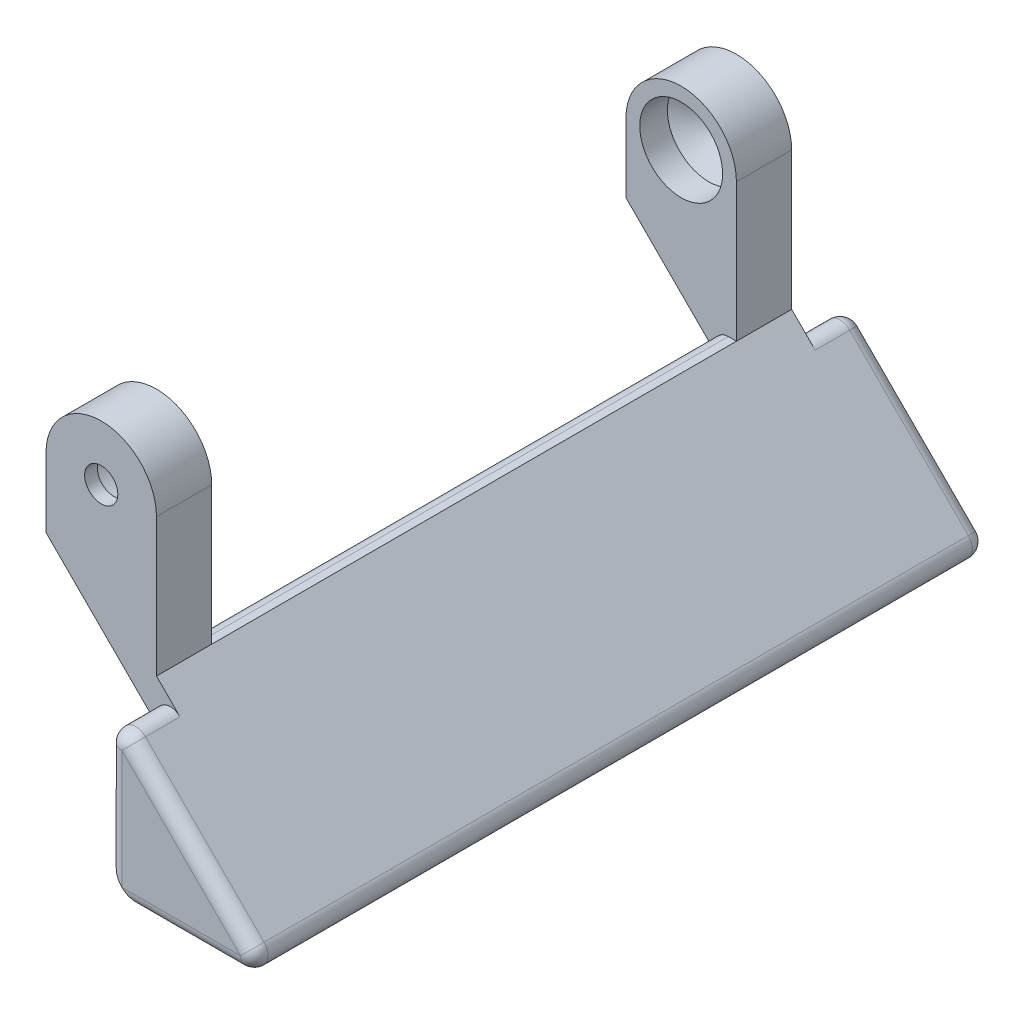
ISO-10303-21;
HEADER;
FILE_DESCRIPTION(('STEP AP214'),'2;1');
FILE_NAME('part.step','',(''),(''),'','','');
FILE_SCHEMA(('AUTOMOTIVE_DESIGN { 1 0 10303 214 1 1 1 1 }'));
ENDSEC;
DATA;
#1=APPLICATION_CONTEXT('core data for automotive mechanical design processes');
#2=APPLICATION_PROTOCOL_DEFINITION('international standard','automotive_design',2000,#1);
#3=PRODUCT_CONTEXT('',#1,'mechanical');
#4=PRODUCT('Part','Part','',(#3));
#5=PRODUCT_RELATED_PRODUCT_CATEGORY('part','',(#4));
#6=PRODUCT_DEFINITION_FORMATION('','',#4);
#7=PRODUCT_DEFINITION_CONTEXT('part definition',#1,'design');
#8=PRODUCT_DEFINITION('design','',#6,#7);
#9=PRODUCT_DEFINITION_SHAPE('','',#8);
#10=(LENGTH_UNIT() NAMED_UNIT(*) SI_UNIT(.MILLI.,.METRE.));
#11=(NAMED_UNIT(*) PLANE_ANGLE_UNIT() SI_UNIT($,.RADIAN.));
#12=(NAMED_UNIT(*) SI_UNIT($,.STERADIAN.) SOLID_ANGLE_UNIT());
#13=UNCERTAINTY_MEASURE_WITH_UNIT(LENGTH_MEASURE(1.E-05),#10,'distance_accuracy_value','');
#14=(GEOMETRIC_REPRESENTATION_CONTEXT(3) GLOBAL_UNCERTAINTY_ASSIGNED_CONTEXT((#13)) GLOBAL_UNIT_ASSIGNED_CONTEXT((#10,
#11,#12)) REPRESENTATION_CONTEXT('',''));
#15=CARTESIAN_POINT('',(0.,0.,0.));
#16=DIRECTION('',(0.,0.,1.));
#17=DIRECTION('',(1.,0.,0.));
#18=AXIS2_PLACEMENT_3D('',#15,#16,#17);
#19=CARTESIAN_POINT('',(0.,0.,53.));
#20=DIRECTION('',(1.,0.,0.));
#21=DIRECTION('',(0.,0.,-1.));
#22=AXIS2_PLACEMENT_3D('',#19,#20,#21);
#23=PLANE('',#22);
#24=DIRECTION('',(0.,1.,0.));
#25=VECTOR('',#24,1.);
#26=CARTESIAN_POINT('',(0.,0.,3.5));
#27=LINE('',#26,#25);
#28=CARTESIAN_POINT('',(0.,17.,3.5));
#29=VERTEX_POINT('',#28);
#30=CARTESIAN_POINT('',(0.,22.,3.5));
#31=VERTEX_POINT('',#30);
#32=EDGE_CURVE('E422',#29,#31,#27,.T.);
#33=ORIENTED_EDGE('',*,*,#32,.F.);
#34=DIRECTION('',(0.,0.,1.));
#35=VECTOR('',#34,1.);
#36=CARTESIAN_POINT('',(0.,17.,0.));
#37=LINE('',#36,#35);
#38=CARTESIAN_POINT('',(0.,17.,7.5));
#39=VERTEX_POINT('',#38);
#40=EDGE_CURVE('E219',#29,#39,#37,.T.);
#41=ORIENTED_EDGE('',*,*,#40,.T.);
#42=DIRECTION('',(0.,1.,0.));
#43=VECTOR('',#42,1.);
#44=CARTESIAN_POINT('',(0.,19.9999999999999,7.5));
#45=LINE('',#44,#43);
#46=CARTESIAN_POINT('',(0.,22.,7.5));
#47=VERTEX_POINT('',#46);
#48=EDGE_CURVE('E417',#39,#47,#45,.T.);
#49=ORIENTED_EDGE('',*,*,#48,.T.);
#50=DIRECTION('',(0.,0.,-1.));
#51=VECTOR('',#50,1.);
#52=CARTESIAN_POINT('',(0.,22.,53.));
#53=LINE('',#52,#51);
#54=EDGE_CURVE('E249',#47,#31,#53,.T.);
#55=ORIENTED_EDGE('',*,*,#54,.T.);
#56=EDGE_LOOP('',(#33,#41,#49,#55));
#57=FACE_BOUND('',#56,.T.);
#58=ADVANCED_FACE('F47',(#57),#23,.F.);
#59=CARTESIAN_POINT('',(4.,22.,53.));
#60=DIRECTION('',(0.,0.,-1.));
#61=DIRECTION('',(-1.,0.,0.));
#62=AXIS2_PLACEMENT_3D('',#59,#60,#61);
#63=CYLINDRICAL_SURFACE('',#62,4.);
#64=CARTESIAN_POINT('',(4.,22.,45.5));
#65=DIRECTION('',(0.,0.,-1.));
#66=DIRECTION('',(-1.,0.,0.));
#67=AXIS2_PLACEMENT_3D('',#64,#65,#66);
#68=CIRCLE('',#67,4.);
#69=CARTESIAN_POINT('',(8.,22.,45.5));
#70=VERTEX_POINT('',#69);
#71=CARTESIAN_POINT('',(0.,22.,45.5));
#72=VERTEX_POINT('',#71);
#73=EDGE_CURVE('E229',#70,#72,#68,.F.);
#74=ORIENTED_EDGE('',*,*,#73,.T.);
#75=CARTESIAN_POINT('',(0.,22.,49.5));
#76=VERTEX_POINT('',#75);
#77=EDGE_CURVE('E246',#76,#72,#53,.T.);
#78=ORIENTED_EDGE('',*,*,#77,.F.);
#79=CARTESIAN_POINT('',(4.,22.,49.5));
#80=DIRECTION('',(0.,0.,-1.));
#81=DIRECTION('',(-1.,0.,0.));
#82=AXIS2_PLACEMENT_3D('',#79,#80,#81);
#83=CIRCLE('',#82,4.);
#84=CARTESIAN_POINT('',(8.,22.,49.5));
#85=VERTEX_POINT('',#84);
#86=EDGE_CURVE('E223',#76,#85,#83,.T.);
#87=ORIENTED_EDGE('',*,*,#86,.T.);
#88=DIRECTION('',(0.,0.,-1.));
#89=VECTOR('',#88,1.);
#90=CARTESIAN_POINT('',(8.,22.,53.));
#91=LINE('',#90,#89);
#92=EDGE_CURVE('E239',#85,#70,#91,.T.);
#93=ORIENTED_EDGE('',*,*,#92,.T.);
#94=EDGE_LOOP('',(#74,#78,#87,#93));
#95=FACE_BOUND('',#94,.T.);
#96=ADVANCED_FACE('F407',(#95),#63,.T.);
#97=CARTESIAN_POINT('',(8.,11.9999999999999,53.));
#98=DIRECTION('',(-1.,0.,0.));
#99=DIRECTION('',(0.,0.,1.));
#100=AXIS2_PLACEMENT_3D('',#97,#98,#99);
#101=PLANE('',#100);
#102=DIRECTION('',(0.,1.,0.));
#103=VECTOR('',#102,1.);
#104=CARTESIAN_POINT('',(8.,22.,45.5));
#105=LINE('',#104,#103);
#106=CARTESIAN_POINT('',(8.,11.9999999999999,45.5));
#107=VERTEX_POINT('',#106);
#108=EDGE_CURVE('E225',#107,#70,#105,.T.);
#109=ORIENTED_EDGE('',*,*,#108,.T.);
#110=ORIENTED_EDGE('',*,*,#92,.F.);
#111=DIRECTION('',(0.,1.,0.));
#112=VECTOR('',#111,1.);
#113=CARTESIAN_POINT('',(8.,0.,49.5));
#114=LINE('',#113,#112);
#115=CARTESIAN_POINT('',(8.,11.9999999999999,49.5));
#116=VERTEX_POINT('',#115);
#117=EDGE_CURVE('E224',#116,#85,#114,.T.);
#118=ORIENTED_EDGE('',*,*,#117,.F.);
#119=DIRECTION('',(0.,0.,-1.));
#120=VECTOR('',#119,1.);
#121=CARTESIAN_POINT('',(8.,11.9999999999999,53.));
#122=LINE('',#121,#120);
#123=EDGE_CURVE('E245',#116,#107,#122,.T.);
#124=ORIENTED_EDGE('',*,*,#123,.T.);
#125=EDGE_LOOP('',(#109,#110,#118,#124));
#126=FACE_BOUND('',#125,.T.);
#127=ADVANCED_FACE('F403',(#126),#101,.F.);
#128=CARTESIAN_POINT('',(4.,22.,53.));
#129=DIRECTION('',(0.,0.,1.));
#130=DIRECTION('',(1.,0.,0.));
#131=AXIS2_PLACEMENT_3D('',#128,#129,#130);
#132=PLANE('',#131);
#133=DIRECTION('',(-0.707106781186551,0.707106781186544,0.));
#134=VECTOR('',#133,1.);
#135=CARTESIAN_POINT('',(7.29289321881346,11.2928932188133,53.));
#136=LINE('',#135,#134);
#137=CARTESIAN_POINT('',(17.5857864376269,1.,53.));
#138=VERTEX_POINT('',#137);
#139=CARTESIAN_POINT('',(9.,9.58578643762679,53.));
#140=VERTEX_POINT('',#139);
#141=EDGE_CURVE('E302',#138,#140,#136,.T.);
#142=ORIENTED_EDGE('',*,*,#141,.T.);
#143=DIRECTION('',(0.,1.,0.));
#144=VECTOR('',#143,1.);
#145=CARTESIAN_POINT('',(9.,2.,53.));
#146=LINE('',#145,#144);
#147=CARTESIAN_POINT('',(9.00000000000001,0.999999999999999,53.));
#148=VERTEX_POINT('',#147);
#149=EDGE_CURVE('E340',#140,#148,#146,.F.);
#150=ORIENTED_EDGE('',*,*,#149,.T.);
#151=DIRECTION('',(1.,0.,0.));
#152=VECTOR('',#151,1.);
#153=CARTESIAN_POINT('',(20.,1.,53.));
#154=LINE('',#153,#152);
#155=EDGE_CURVE('E300',#148,#138,#154,.T.);
#156=ORIENTED_EDGE('',*,*,#155,.T.);
#157=EDGE_LOOP('',(#142,#150,#156));
#158=FACE_BOUND('',#157,.T.);
#159=ADVANCED_FACE('F385',(#158),#132,.T.);
#160=CARTESIAN_POINT('',(4.,22.,0.));
#161=DIRECTION('',(0.,0.,1.));
#162=DIRECTION('',(1.,0.,0.));
#163=AXIS2_PLACEMENT_3D('',#160,#161,#162);
#164=PLANE('',#163);
#165=DIRECTION('',(1.,0.,0.));
#166=VECTOR('',#165,1.);
#167=CARTESIAN_POINT('',(4.,1.,0.));
#168=LINE('',#167,#166);
#169=CARTESIAN_POINT('',(17.5857864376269,1.,0.));
#170=VERTEX_POINT('',#169);
#171=CARTESIAN_POINT('',(9.00000000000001,1.,0.));
#172=VERTEX_POINT('',#171);
#173=EDGE_CURVE('E290',#170,#172,#168,.F.);
#174=ORIENTED_EDGE('',*,*,#173,.T.);
#175=DIRECTION('',(0.,-1.,0.));
#176=VECTOR('',#175,1.);
#177=CARTESIAN_POINT('',(9.,22.,0.));
#178=LINE('',#177,#176);
#179=CARTESIAN_POINT('',(9.,9.58578643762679,0.));
#180=VERTEX_POINT('',#179);
#181=EDGE_CURVE('E336',#172,#180,#178,.F.);
#182=ORIENTED_EDGE('',*,*,#181,.T.);
#183=DIRECTION('',(-0.707106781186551,0.707106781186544,0.));
#184=VECTOR('',#183,1.);
#185=CARTESIAN_POINT('',(0.292893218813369,18.2928932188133,0.));
#186=LINE('',#185,#184);
#187=EDGE_CURVE('E293',#180,#170,#186,.F.);
#188=ORIENTED_EDGE('',*,*,#187,.T.);
#189=EDGE_LOOP('',(#174,#182,#188));
#190=FACE_BOUND('',#189,.T.);
#191=ADVANCED_FACE('F444',(#190),#164,.F.);
#192=ORIENTED_EDGE('',*,*,#54,.F.);
#193=CARTESIAN_POINT('',(4.,22.,7.5));
#194=DIRECTION('',(0.,0.,-1.));
#195=DIRECTION('',(0.,1.,0.));
#196=AXIS2_PLACEMENT_3D('',#193,#194,#195);
#197=CIRCLE('',#196,4.);
#198=CARTESIAN_POINT('',(8.,22.,7.5));
#199=VERTEX_POINT('',#198);
#200=EDGE_CURVE('E410',#47,#199,#197,.T.);
#201=ORIENTED_EDGE('',*,*,#200,.T.);
#202=CARTESIAN_POINT('',(8.,22.,3.5));
#203=VERTEX_POINT('',#202);
#204=EDGE_CURVE('E238',#199,#203,#91,.T.);
#205=ORIENTED_EDGE('',*,*,#204,.T.);
#206=CARTESIAN_POINT('',(4.,22.,3.5));
#207=DIRECTION('',(0.,0.,1.));
#208=DIRECTION('',(1.,0.,0.));
#209=AXIS2_PLACEMENT_3D('',#206,#207,#208);
#210=CIRCLE('',#209,4.);
#211=EDGE_CURVE('E234',#203,#31,#210,.T.);
#212=ORIENTED_EDGE('',*,*,#211,.T.);
#213=EDGE_LOOP('',(#192,#201,#205,#212));
#214=FACE_BOUND('',#213,.T.);
#215=ADVANCED_FACE('F471',(#214),#63,.T.);
#216=DIRECTION('',(0.,-1.,0.));
#217=VECTOR('',#216,1.);
#218=CARTESIAN_POINT('',(0.,19.9999999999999,45.5));
#219=LINE('',#218,#217);
#220=CARTESIAN_POINT('',(0.,17.,45.5));
#221=VERTEX_POINT('',#220);
#222=EDGE_CURVE('E218',#72,#221,#219,.T.);
#223=ORIENTED_EDGE('',*,*,#222,.T.);
#224=CARTESIAN_POINT('',(0.,17.,49.5));
#225=VERTEX_POINT('',#224);
#226=EDGE_CURVE('E201',#221,#225,#37,.T.);
#227=ORIENTED_EDGE('',*,*,#226,.T.);
#228=DIRECTION('',(0.,-1.,0.));
#229=VECTOR('',#228,1.);
#230=CARTESIAN_POINT('',(0.,0.,49.5));
#231=LINE('',#230,#229);
#232=EDGE_CURVE('E216',#76,#225,#231,.T.);
#233=ORIENTED_EDGE('',*,*,#232,.F.);
#234=ORIENTED_EDGE('',*,*,#77,.T.);
#235=EDGE_LOOP('',(#223,#227,#233,#234));
#236=FACE_BOUND('',#235,.T.);
#237=ADVANCED_FACE('F214',(#236),#23,.F.);
#238=CARTESIAN_POINT('',(0.,0.,53.));
#239=DIRECTION('',(0.,1.,0.));
#240=DIRECTION('',(0.,0.,1.));
#241=AXIS2_PLACEMENT_3D('',#238,#239,#240);
#242=PLANE('',#241);
#243=DIRECTION('',(0.,0.,-1.));
#244=VECTOR('',#243,1.);
#245=CARTESIAN_POINT('',(10.,0.,53.));
#246=LINE('',#245,#244);
#247=CARTESIAN_POINT('',(10.,0.,52.));
#248=VERTEX_POINT('',#247);
#249=CARTESIAN_POINT('',(10.,0.,1.));
#250=VERTEX_POINT('',#249);
#251=EDGE_CURVE('E252',#248,#250,#246,.T.);
#252=ORIENTED_EDGE('',*,*,#251,.T.);
#253=DIRECTION('',(1.,0.,0.));
#254=VECTOR('',#253,1.);
#255=CARTESIAN_POINT('',(0.,0.,1.));
#256=LINE('',#255,#254);
#257=CARTESIAN_POINT('',(17.5857864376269,0.,1.));
#258=VERTEX_POINT('',#257);
#259=EDGE_CURVE('E288',#250,#258,#256,.T.);
#260=ORIENTED_EDGE('',*,*,#259,.T.);
#261=DIRECTION('',(0.,0.,-1.));
#262=VECTOR('',#261,1.);
#263=CARTESIAN_POINT('',(17.5857864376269,0.,53.));
#264=LINE('',#263,#262);
#265=CARTESIAN_POINT('',(17.5857864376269,0.,52.));
#266=VERTEX_POINT('',#265);
#267=EDGE_CURVE('E286',#258,#266,#264,.F.);
#268=ORIENTED_EDGE('',*,*,#267,.T.);
#269=DIRECTION('',(1.,0.,0.));
#270=VECTOR('',#269,1.);
#271=CARTESIAN_POINT('',(10.,0.,52.));
#272=LINE('',#271,#270);
#273=EDGE_CURVE('E284',#266,#248,#272,.F.);
#274=ORIENTED_EDGE('',*,*,#273,.T.);
#275=EDGE_LOOP('',(#252,#260,#268,#274));
#276=FACE_BOUND('',#275,.T.);
#277=ADVANCED_FACE('F453',(#276),#242,.F.);
#278=CARTESIAN_POINT('',(20.,0.,53.));
#279=DIRECTION('',(-0.707106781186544,-0.707106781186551,0.));
#280=DIRECTION('',(0.707106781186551,-0.707106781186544,0.));
#281=AXIS2_PLACEMENT_3D('',#278,#279,#280);
#282=PLANE('',#281);
#283=DIRECTION('',(-0.707106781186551,0.707106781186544,0.));
#284=VECTOR('',#283,1.);
#285=CARTESIAN_POINT('',(20.,0.,1.));
#286=LINE('',#285,#284);
#287=CARTESIAN_POINT('',(18.2928932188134,1.70710678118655,1.));
#288=VERTEX_POINT('',#287);
#289=CARTESIAN_POINT('',(9.70710678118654,10.2928932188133,1.));
#290=VERTEX_POINT('',#289);
#291=EDGE_CURVE('E281',#288,#290,#286,.T.);
#292=ORIENTED_EDGE('',*,*,#291,.T.);
#293=DIRECTION('',(0.,0.,-1.));
#294=VECTOR('',#293,1.);
#295=CARTESIAN_POINT('',(9.70710678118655,10.2928932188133,53.));
#296=LINE('',#295,#294);
#297=CARTESIAN_POINT('',(9.70710678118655,10.2928932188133,3.5));
#298=VERTEX_POINT('',#297);
#299=EDGE_CURVE('E348',#290,#298,#296,.F.);
#300=ORIENTED_EDGE('',*,*,#299,.T.);
#301=DIRECTION('',(-0.707106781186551,0.707106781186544,0.));
#302=VECTOR('',#301,1.);
#303=CARTESIAN_POINT('',(20.,0.,3.5));
#304=LINE('',#303,#302);
#305=CARTESIAN_POINT('',(8.,11.9999999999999,3.5));
#306=VERTEX_POINT('',#305);
#307=EDGE_CURVE('E71',#298,#306,#304,.T.);
#308=ORIENTED_EDGE('',*,*,#307,.T.);
#309=CARTESIAN_POINT('',(8.,12.,7.49999999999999));
#310=VERTEX_POINT('',#309);
#311=EDGE_CURVE('E242',#310,#306,#122,.T.);
#312=ORIENTED_EDGE('',*,*,#311,.F.);
#313=DIRECTION('',(0.,0.,1.));
#314=VECTOR('',#313,1.);
#315=CARTESIAN_POINT('',(7.99999999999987,12.,53.));
#316=LINE('',#315,#314);
#317=EDGE_CURVE('E399',#310,#107,#316,.T.);
#318=ORIENTED_EDGE('',*,*,#317,.T.);
#319=ORIENTED_EDGE('',*,*,#123,.F.);
#320=DIRECTION('',(0.707106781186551,-0.707106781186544,0.));
#321=VECTOR('',#320,1.);
#322=CARTESIAN_POINT('',(20.,0.,49.5));
#323=LINE('',#322,#321);
#324=CARTESIAN_POINT('',(9.70710678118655,10.2928932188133,49.5));
#325=VERTEX_POINT('',#324);
#326=EDGE_CURVE('E63',#116,#325,#323,.T.);
#327=ORIENTED_EDGE('',*,*,#326,.T.);
#328=DIRECTION('',(0.,0.,-1.));
#329=VECTOR('',#328,1.);
#330=CARTESIAN_POINT('',(9.70710678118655,10.2928932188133,53.));
#331=LINE('',#330,#329);
#332=CARTESIAN_POINT('',(9.70710678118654,10.2928932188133,52.));
#333=VERTEX_POINT('',#332);
#334=EDGE_CURVE('E344',#325,#333,#331,.F.);
#335=ORIENTED_EDGE('',*,*,#334,.T.);
#336=DIRECTION('',(-0.707106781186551,0.707106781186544,0.));
#337=VECTOR('',#336,1.);
#338=CARTESIAN_POINT('',(20.,0.,52.));
#339=LINE('',#338,#337);
#340=CARTESIAN_POINT('',(18.2928932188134,1.70710678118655,52.));
#341=VERTEX_POINT('',#340);
#342=EDGE_CURVE('E276',#333,#341,#339,.F.);
#343=ORIENTED_EDGE('',*,*,#342,.T.);
#344=DIRECTION('',(0.,0.,-1.));
#345=VECTOR('',#344,1.);
#346=CARTESIAN_POINT('',(18.2928932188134,1.70710678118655,53.));
#347=LINE('',#346,#345);
#348=EDGE_CURVE('E278',#341,#288,#347,.T.);
#349=ORIENTED_EDGE('',*,*,#348,.T.);
#350=EDGE_LOOP('',(#292,#300,#308,#312,#318,#319,#327,#335,#343,#349));
#351=FACE_BOUND('',#350,.T.);
#352=ADVANCED_FACE('F392',(#351),#282,.F.);
#353=ORIENTED_EDGE('',*,*,#204,.F.);
#354=DIRECTION('',(0.,-1.,0.));
#355=VECTOR('',#354,1.);
#356=CARTESIAN_POINT('',(8.,22.,7.5));
#357=LINE('',#356,#355);
#358=EDGE_CURVE('E414',#199,#310,#357,.T.);
#359=ORIENTED_EDGE('',*,*,#358,.T.);
#360=ORIENTED_EDGE('',*,*,#311,.T.);
#361=DIRECTION('',(0.,-1.,0.));
#362=VECTOR('',#361,1.);
#363=CARTESIAN_POINT('',(8.,0.,3.5));
#364=LINE('',#363,#362);
#365=EDGE_CURVE('E235',#203,#306,#364,.T.);
#366=ORIENTED_EDGE('',*,*,#365,.F.);
#367=EDGE_LOOP('',(#353,#359,#360,#366));
#368=FACE_BOUND('',#367,.T.);
#369=ADVANCED_FACE('F467',(#368),#101,.F.);
#370=CARTESIAN_POINT('',(8.,0.,0.));
#371=DIRECTION('',(1.,0.,0.));
#372=DIRECTION('',(0.,0.,-1.));
#373=AXIS2_PLACEMENT_3D('',#370,#371,#372);
#374=PLANE('',#373);
#375=DIRECTION('',(0.,0.,-1.));
#376=VECTOR('',#375,1.);
#377=CARTESIAN_POINT('',(8.,9.58578643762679,0.));
#378=LINE('',#377,#376);
#379=CARTESIAN_POINT('',(8.,9.58578643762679,3.5));
#380=VERTEX_POINT('',#379);
#381=CARTESIAN_POINT('',(8.,9.58578643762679,1.));
#382=VERTEX_POINT('',#381);
#383=EDGE_CURVE('E327',#380,#382,#378,.T.);
#384=ORIENTED_EDGE('',*,*,#383,.T.);
#385=DIRECTION('',(0.,-1.,0.));
#386=VECTOR('',#385,1.);
#387=CARTESIAN_POINT('',(8.,0.,1.));
#388=LINE('',#387,#386);
#389=CARTESIAN_POINT('',(8.,2.,1.));
#390=VERTEX_POINT('',#389);
#391=EDGE_CURVE('E329',#382,#390,#388,.T.);
#392=ORIENTED_EDGE('',*,*,#391,.T.);
#393=DIRECTION('',(0.,0.,1.));
#394=VECTOR('',#393,1.);
#395=CARTESIAN_POINT('',(8.,2.,0.));
#396=LINE('',#395,#394);
#397=CARTESIAN_POINT('',(8.,2.,52.));
#398=VERTEX_POINT('',#397);
#399=EDGE_CURVE('E248',#390,#398,#396,.T.);
#400=ORIENTED_EDGE('',*,*,#399,.T.);
#401=DIRECTION('',(0.,1.,0.));
#402=VECTOR('',#401,1.);
#403=CARTESIAN_POINT('',(8.,10.5857864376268,52.));
#404=LINE('',#403,#402);
#405=CARTESIAN_POINT('',(8.,9.58578643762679,52.));
#406=VERTEX_POINT('',#405);
#407=EDGE_CURVE('E324',#398,#406,#404,.T.);
#408=ORIENTED_EDGE('',*,*,#407,.T.);
#409=DIRECTION('',(0.,0.,-1.));
#410=VECTOR('',#409,1.);
#411=CARTESIAN_POINT('',(8.,9.58578643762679,0.));
#412=LINE('',#411,#410);
#413=CARTESIAN_POINT('',(8.,9.58578643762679,49.5));
#414=VERTEX_POINT('',#413);
#415=EDGE_CURVE('E305',#406,#414,#412,.T.);
#416=ORIENTED_EDGE('',*,*,#415,.T.);
#417=CARTESIAN_POINT('',(8.,9.,49.5));
#418=VERTEX_POINT('',#417);
#419=EDGE_CURVE('E227',#418,#414,#114,.T.);
#420=ORIENTED_EDGE('',*,*,#419,.F.);
#421=DIRECTION('',(0.,0.,-1.));
#422=VECTOR('',#421,1.);
#423=CARTESIAN_POINT('',(8.,9.,3.5));
#424=LINE('',#423,#422);
#425=CARTESIAN_POINT('',(8.,9.,3.5));
#426=VERTEX_POINT('',#425);
#427=EDGE_CURVE('E205',#418,#426,#424,.T.);
#428=ORIENTED_EDGE('',*,*,#427,.T.);
#429=EDGE_CURVE('E421',#380,#426,#364,.T.);
#430=ORIENTED_EDGE('',*,*,#429,.F.);
#431=EDGE_LOOP('',(#384,#392,#400,#408,#416,#420,#428,#430));
#432=FACE_BOUND('',#431,.T.);
#433=ADVANCED_FACE('F370',(#432),#374,.F.);
#434=CARTESIAN_POINT('',(34.2345192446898,0.,49.5));
#435=DIRECTION('',(0.,0.,-1.));
#436=DIRECTION('',(-1.,0.,0.));
#437=AXIS2_PLACEMENT_3D('',#434,#435,#436);
#438=PLANE('',#437);
#439=CARTESIAN_POINT('',(4.,22.,49.5));
#440=DIRECTION('',(0.,0.,-1.));
#441=DIRECTION('',(-1.,0.,0.));
#442=AXIS2_PLACEMENT_3D('',#439,#440,#441);
#443=CIRCLE('',#442,1.2);
#444=CARTESIAN_POINT('',(2.8,22.,49.5));
#445=VERTEX_POINT('',#444);
#446=EDGE_CURVE('E261',#445,#445,#443,.T.);
#447=ORIENTED_EDGE('',*,*,#446,.T.);
#448=EDGE_LOOP('',(#447));
#449=FACE_BOUND('',#448,.T.);
#450=ORIENTED_EDGE('',*,*,#232,.T.);
#451=DIRECTION('',(-0.707106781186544,0.707106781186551,0.));
#452=VECTOR('',#451,1.);
#453=CARTESIAN_POINT('',(25.6172596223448,-8.61725962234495,49.5));
#454=LINE('',#453,#452);
#455=EDGE_CURVE('E198',#225,#418,#454,.F.);
#456=ORIENTED_EDGE('',*,*,#455,.T.);
#457=ORIENTED_EDGE('',*,*,#419,.T.);
#458=CARTESIAN_POINT('',(9.,9.58578643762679,49.5));
#459=DIRECTION('',(0.,0.,-1.));
#460=DIRECTION('',(-1.,0.,0.));
#461=AXIS2_PLACEMENT_3D('',#458,#459,#460);
#462=CIRCLE('',#461,1.);
#463=EDGE_CURVE('E13',#414,#325,#462,.T.);
#464=ORIENTED_EDGE('',*,*,#463,.T.);
#465=ORIENTED_EDGE('',*,*,#326,.F.);
#466=ORIENTED_EDGE('',*,*,#117,.T.);
#467=ORIENTED_EDGE('',*,*,#86,.F.);
#468=EDGE_LOOP('',(#450,#456,#457,#464,#465,#466,#467));
#469=FACE_BOUND('',#468,.T.);
#470=ADVANCED_FACE('F222',(#449,#469),#438,.F.);
#471=CARTESIAN_POINT('',(34.2345192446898,0.,3.5));
#472=DIRECTION('',(0.,0.,1.));
#473=DIRECTION('',(1.,0.,0.));
#474=AXIS2_PLACEMENT_3D('',#471,#472,#473);
#475=PLANE('',#474);
#476=CARTESIAN_POINT('',(4.,22.,3.5));
#477=DIRECTION('',(0.,0.,1.));
#478=DIRECTION('',(1.,0.,0.));
#479=AXIS2_PLACEMENT_3D('',#476,#477,#478);
#480=CIRCLE('',#479,1.2);
#481=CARTESIAN_POINT('',(5.2,22.,3.5));
#482=VERTEX_POINT('',#481);
#483=EDGE_CURVE('E257',#482,#482,#480,.T.);
#484=ORIENTED_EDGE('',*,*,#483,.T.);
#485=EDGE_LOOP('',(#484));
#486=FACE_BOUND('',#485,.T.);
#487=DIRECTION('',(0.707106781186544,-0.707106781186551,0.));
#488=VECTOR('',#487,1.);
#489=CARTESIAN_POINT('',(25.6172596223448,-8.61725962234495,3.5));
#490=LINE('',#489,#488);
#491=EDGE_CURVE('E209',#426,#29,#490,.F.);
#492=ORIENTED_EDGE('',*,*,#491,.T.);
#493=ORIENTED_EDGE('',*,*,#32,.T.);
#494=ORIENTED_EDGE('',*,*,#211,.F.);
#495=ORIENTED_EDGE('',*,*,#365,.T.);
#496=ORIENTED_EDGE('',*,*,#307,.F.);
#497=CARTESIAN_POINT('',(9.,9.58578643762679,3.5));
#498=DIRECTION('',(0.,0.,1.));
#499=DIRECTION('',(1.,0.,0.));
#500=AXIS2_PLACEMENT_3D('',#497,#498,#499);
#501=CIRCLE('',#500,1.);
#502=EDGE_CURVE('E56',#298,#380,#501,.T.);
#503=ORIENTED_EDGE('',*,*,#502,.T.);
#504=ORIENTED_EDGE('',*,*,#429,.T.);
#505=EDGE_LOOP('',(#492,#493,#494,#495,#496,#503,#504));
#506=FACE_BOUND('',#505,.T.);
#507=ADVANCED_FACE('F468',(#486,#506),#475,.F.);
#508=CARTESIAN_POINT('',(8.,2.,0.));
#509=DIRECTION('',(0.707106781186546,0.707106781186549,0.));
#510=DIRECTION('',(0.,0.,1.));
#511=AXIS2_PLACEMENT_3D('',#508,#509,#510);
#512=PLANE('',#511);
#513=ORIENTED_EDGE('',*,*,#399,.F.);
#514=CARTESIAN_POINT('',(9.,1.,1.));
#515=DIRECTION('',(0.707106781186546,0.707106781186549,0.));
#516=DIRECTION('',(0.707106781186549,-0.707106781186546,0.));
#517=AXIS2_PLACEMENT_3D('',#514,#515,#516);
#518=ELLIPSE('',#517,1.41421356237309,1.);
#519=EDGE_CURVE('E334',#390,#172,#518,.F.);
#520=ORIENTED_EDGE('',*,*,#519,.T.);
#521=CARTESIAN_POINT('',(9.00000000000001,1.,1.));
#522=DIRECTION('',(0.707106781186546,0.707106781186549,0.));
#523=DIRECTION('',(0.707106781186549,-0.707106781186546,0.));
#524=AXIS2_PLACEMENT_3D('',#521,#522,#523);
#525=ELLIPSE('',#524,1.4142135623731,1.);
#526=EDGE_CURVE('E298',#172,#250,#525,.F.);
#527=ORIENTED_EDGE('',*,*,#526,.T.);
#528=ORIENTED_EDGE('',*,*,#251,.F.);
#529=CARTESIAN_POINT('',(9.00000000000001,1.,52.));
#530=DIRECTION('',(0.707106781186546,0.707106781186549,0.));
#531=DIRECTION('',(-0.707106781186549,0.707106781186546,0.));
#532=AXIS2_PLACEMENT_3D('',#529,#530,#531);
#533=ELLIPSE('',#532,1.4142135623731,1.);
#534=EDGE_CURVE('E295',#248,#148,#533,.F.);
#535=ORIENTED_EDGE('',*,*,#534,.T.);
#536=CARTESIAN_POINT('',(9.,1.,52.));
#537=DIRECTION('',(0.707106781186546,0.707106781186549,0.));
#538=DIRECTION('',(0.707106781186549,-0.707106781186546,0.));
#539=AXIS2_PLACEMENT_3D('',#536,#537,#538);
#540=ELLIPSE('',#539,1.41421356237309,1.);
#541=EDGE_CURVE('E332',#148,#398,#540,.F.);
#542=ORIENTED_EDGE('',*,*,#541,.T.);
#543=EDGE_LOOP('',(#513,#520,#527,#528,#535,#542));
#544=FACE_BOUND('',#543,.T.);
#545=ADVANCED_FACE('F375',(#544),#512,.F.);
#546=CARTESIAN_POINT('',(8.,9.,0.));
#547=DIRECTION('',(-0.707106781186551,-0.707106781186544,0.));
#548=DIRECTION('',(0.,0.,1.));
#549=AXIS2_PLACEMENT_3D('',#546,#547,#548);
#550=PLANE('',#549);
#551=DIRECTION('',(0.707106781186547,-0.707106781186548,0.));
#552=VECTOR('',#551,1.);
#553=CARTESIAN_POINT('',(25.6172596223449,-8.61725962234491,45.5));
#554=LINE('',#553,#552);
#555=CARTESIAN_POINT('',(6.70710678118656,10.2928932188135,45.5));
#556=VERTEX_POINT('',#555);
#557=EDGE_CURVE('E502',#221,#556,#554,.T.);
#558=ORIENTED_EDGE('',*,*,#557,.T.);
#559=DIRECTION('',(0.,0.,1.));
#560=VECTOR('',#559,1.);
#561=CARTESIAN_POINT('',(6.70710678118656,10.2928932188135,0.));
#562=LINE('',#561,#560);
#563=CARTESIAN_POINT('',(6.70710678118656,10.2928932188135,7.5));
#564=VERTEX_POINT('',#563);
#565=EDGE_CURVE('E268',#556,#564,#562,.F.);
#566=ORIENTED_EDGE('',*,*,#565,.T.);
#567=DIRECTION('',(0.707106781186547,-0.707106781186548,0.));
#568=VECTOR('',#567,1.);
#569=CARTESIAN_POINT('',(-0.499999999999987,17.5,7.5));
#570=LINE('',#569,#568);
#571=EDGE_CURVE('E265',#39,#564,#570,.T.);
#572=ORIENTED_EDGE('',*,*,#571,.F.);
#573=ORIENTED_EDGE('',*,*,#40,.F.);
#574=ORIENTED_EDGE('',*,*,#491,.F.);
#575=ORIENTED_EDGE('',*,*,#427,.F.);
#576=ORIENTED_EDGE('',*,*,#455,.F.);
#577=ORIENTED_EDGE('',*,*,#226,.F.);
#578=EDGE_LOOP('',(#558,#566,#572,#573,#574,#575,#576,#577));
#579=FACE_BOUND('',#578,.T.);
#580=ADVANCED_FACE('F200',(#579),#550,.T.);
#581=CARTESIAN_POINT('',(4.,22.,7.5));
#582=DIRECTION('',(0.,0.,-1.));
#583=DIRECTION('',(0.,1.,0.));
#584=AXIS2_PLACEMENT_3D('',#581,#582,#583);
#585=PLANE('',#584);
#586=CARTESIAN_POINT('',(4.,22.,7.50000000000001));
#587=DIRECTION('',(0.,0.,1.));
#588=DIRECTION('',(0.,-1.,0.));
#589=AXIS2_PLACEMENT_3D('',#586,#587,#588);
#590=CIRCLE('',#589,2.99999999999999);
#591=CARTESIAN_POINT('',(4.,19.,7.50000000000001));
#592=VERTEX_POINT('',#591);
#593=EDGE_CURVE('E488',#592,#592,#590,.T.);
#594=ORIENTED_EDGE('',*,*,#593,.F.);
#595=EDGE_LOOP('',(#594));
#596=FACE_BOUND('',#595,.T.);
#597=ORIENTED_EDGE('',*,*,#48,.F.);
#598=ORIENTED_EDGE('',*,*,#571,.T.);
#599=CARTESIAN_POINT('',(7.41421356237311,11.,7.5));
#600=DIRECTION('',(0.,0.,-1.));
#601=DIRECTION('',(0.,1.,0.));
#602=AXIS2_PLACEMENT_3D('',#599,#600,#601);
#603=CIRCLE('',#602,1.);
#604=CARTESIAN_POINT('',(7.41421356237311,12.,7.49999999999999));
#605=VERTEX_POINT('',#604);
#606=EDGE_CURVE('E274',#564,#605,#603,.T.);
#607=ORIENTED_EDGE('',*,*,#606,.T.);
#608=DIRECTION('',(1.,0.,0.));
#609=VECTOR('',#608,1.);
#610=CARTESIAN_POINT('',(0.,12.,7.49999999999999));
#611=LINE('',#610,#609);
#612=EDGE_CURVE('E477',#605,#310,#611,.T.);
#613=ORIENTED_EDGE('',*,*,#612,.T.);
#614=ORIENTED_EDGE('',*,*,#358,.F.);
#615=ORIENTED_EDGE('',*,*,#200,.F.);
#616=EDGE_LOOP('',(#597,#598,#607,#613,#614,#615));
#617=FACE_BOUND('',#616,.T.);
#618=ADVANCED_FACE('F475',(#596,#617),#585,.F.);
#619=CARTESIAN_POINT('',(34.2345192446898,0.,45.5));
#620=DIRECTION('',(0.,0.,-1.));
#621=DIRECTION('',(-1.,0.,0.));
#622=AXIS2_PLACEMENT_3D('',#619,#620,#621);
#623=PLANE('',#622);
#624=ORIENTED_EDGE('',*,*,#557,.F.);
#625=ORIENTED_EDGE('',*,*,#222,.F.);
#626=ORIENTED_EDGE('',*,*,#73,.F.);
#627=ORIENTED_EDGE('',*,*,#108,.F.);
#628=DIRECTION('',(1.,0.,0.));
#629=VECTOR('',#628,1.);
#630=CARTESIAN_POINT('',(0.,12.,45.5));
#631=LINE('',#630,#629);
#632=CARTESIAN_POINT('',(7.41421356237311,12.,45.5));
#633=VERTEX_POINT('',#632);
#634=EDGE_CURVE('E481',#633,#107,#631,.T.);
#635=ORIENTED_EDGE('',*,*,#634,.F.);
#636=CARTESIAN_POINT('',(7.41421356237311,11.,45.5));
#637=DIRECTION('',(0.,0.,-1.));
#638=DIRECTION('',(-1.,0.,0.));
#639=AXIS2_PLACEMENT_3D('',#636,#637,#638);
#640=CIRCLE('',#639,1.);
#641=EDGE_CURVE('E271',#633,#556,#640,.F.);
#642=ORIENTED_EDGE('',*,*,#641,.T.);
#643=EDGE_LOOP('',(#624,#625,#626,#627,#635,#642));
#644=FACE_BOUND('',#643,.T.);
#645=CARTESIAN_POINT('',(4.,22.,45.5));
#646=DIRECTION('',(0.,0.,-1.));
#647=DIRECTION('',(-1.,0.,0.));
#648=AXIS2_PLACEMENT_3D('',#645,#646,#647);
#649=CIRCLE('',#648,2.99999999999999);
#650=CARTESIAN_POINT('',(1.00000000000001,22.,45.5));
#651=VERTEX_POINT('',#650);
#652=EDGE_CURVE('E494',#651,#651,#649,.T.);
#653=ORIENTED_EDGE('',*,*,#652,.F.);
#654=EDGE_LOOP('',(#653));
#655=FACE_BOUND('',#654,.T.);
#656=ADVANCED_FACE('F511',(#644,#655),#623,.T.);
#657=CARTESIAN_POINT('',(0.,12.,45.5));
#658=DIRECTION('',(0.,-1.,0.));
#659=DIRECTION('',(0.,0.,-1.));
#660=AXIS2_PLACEMENT_3D('',#657,#658,#659);
#661=PLANE('',#660);
#662=ORIENTED_EDGE('',*,*,#612,.F.);
#663=DIRECTION('',(0.,0.,-1.));
#664=VECTOR('',#663,1.);
#665=CARTESIAN_POINT('',(7.41421356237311,12.,45.5));
#666=LINE('',#665,#664);
#667=EDGE_CURVE('E208',#605,#633,#666,.F.);
#668=ORIENTED_EDGE('',*,*,#667,.T.);
#669=ORIENTED_EDGE('',*,*,#634,.T.);
#670=ORIENTED_EDGE('',*,*,#317,.F.);
#671=EDGE_LOOP('',(#662,#668,#669,#670));
#672=FACE_BOUND('',#671,.T.);
#673=ADVANCED_FACE('F510',(#672),#661,.F.);
#674=CARTESIAN_POINT('',(4.,22.,5.5));
#675=DIRECTION('',(0.,0.,1.));
#676=DIRECTION('',(0.,-1.,0.));
#677=AXIS2_PLACEMENT_3D('',#674,#675,#676);
#678=CONICAL_SURFACE('',#677,3.,1.02974425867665);
#679=CARTESIAN_POINT('',(4.,22.,4.41845088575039));
#680=DIRECTION('',(0.,0.,1.));
#681=DIRECTION('',(0.,-1.,0.));
#682=AXIS2_PLACEMENT_3D('',#679,#680,#681);
#683=CIRCLE('',#682,1.2);
#684=CARTESIAN_POINT('',(4.,20.8,4.41845088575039));
#685=VERTEX_POINT('',#684);
#686=EDGE_CURVE('E260',#685,#685,#683,.F.);
#687=ORIENTED_EDGE('',*,*,#686,.T.);
#688=EDGE_LOOP('',(#687));
#689=FACE_BOUND('',#688,.T.);
#690=CARTESIAN_POINT('',(4.,22.,5.5));
#691=DIRECTION('',(0.,0.,1.));
#692=DIRECTION('',(0.,-1.,0.));
#693=AXIS2_PLACEMENT_3D('',#690,#691,#692);
#694=CIRCLE('',#693,3.);
#695=CARTESIAN_POINT('',(4.,19.,5.50000000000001));
#696=VERTEX_POINT('',#695);
#697=EDGE_CURVE('E483',#696,#696,#694,.T.);
#698=ORIENTED_EDGE('',*,*,#697,.T.);
#699=EDGE_LOOP('',(#698));
#700=FACE_BOUND('',#699,.T.);
#701=ADVANCED_FACE('F705',(#689,#700),#678,.F.);
#702=CARTESIAN_POINT('',(4.,22.,7.5));
#703=DIRECTION('',(0.,0.,1.));
#704=DIRECTION('',(0.,-1.,0.));
#705=AXIS2_PLACEMENT_3D('',#702,#703,#704);
#706=CYLINDRICAL_SURFACE('',#705,2.99999999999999);
#707=ORIENTED_EDGE('',*,*,#697,.F.);
#708=EDGE_LOOP('',(#707));
#709=FACE_BOUND('',#708,.T.);
#710=ORIENTED_EDGE('',*,*,#593,.T.);
#711=EDGE_LOOP('',(#710));
#712=FACE_BOUND('',#711,.T.);
#713=ADVANCED_FACE('F530',(#709,#712),#706,.F.);
#714=CARTESIAN_POINT('',(4.,22.,47.5));
#715=DIRECTION('',(0.,0.,-1.));
#716=DIRECTION('',(-1.,0.,0.));
#717=AXIS2_PLACEMENT_3D('',#714,#715,#716);
#718=CONICAL_SURFACE('',#717,2.99999999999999,1.02974425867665);
#719=CARTESIAN_POINT('',(4.,22.,48.5815491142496));
#720=DIRECTION('',(0.,0.,-1.));
#721=DIRECTION('',(-1.,0.,0.));
#722=AXIS2_PLACEMENT_3D('',#719,#720,#721);
#723=CIRCLE('',#722,1.2);
#724=CARTESIAN_POINT('',(2.8,22.,48.5815491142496));
#725=VERTEX_POINT('',#724);
#726=EDGE_CURVE('E262',#725,#725,#723,.F.);
#727=ORIENTED_EDGE('',*,*,#726,.T.);
#728=EDGE_LOOP('',(#727));
#729=FACE_BOUND('',#728,.T.);
#730=CARTESIAN_POINT('',(4.,22.,47.5));
#731=DIRECTION('',(0.,0.,-1.));
#732=DIRECTION('',(-1.,0.,0.));
#733=AXIS2_PLACEMENT_3D('',#730,#731,#732);
#734=CIRCLE('',#733,2.99999999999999);
#735=CARTESIAN_POINT('',(1.00000000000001,22.,47.5));
#736=VERTEX_POINT('',#735);
#737=EDGE_CURVE('E491',#736,#736,#734,.T.);
#738=ORIENTED_EDGE('',*,*,#737,.T.);
#739=EDGE_LOOP('',(#738));
#740=FACE_BOUND('',#739,.T.);
#741=ADVANCED_FACE('F520',(#729,#740),#718,.F.);
#742=CARTESIAN_POINT('',(4.,22.,45.5));
#743=DIRECTION('',(0.,0.,-1.));
#744=DIRECTION('',(-1.,0.,0.));
#745=AXIS2_PLACEMENT_3D('',#742,#743,#744);
#746=CYLINDRICAL_SURFACE('',#745,2.99999999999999);
#747=ORIENTED_EDGE('',*,*,#737,.F.);
#748=EDGE_LOOP('',(#747));
#749=FACE_BOUND('',#748,.T.);
#750=ORIENTED_EDGE('',*,*,#652,.T.);
#751=EDGE_LOOP('',(#750));
#752=FACE_BOUND('',#751,.T.);
#753=ADVANCED_FACE('F517',(#749,#752),#746,.F.);
#754=CARTESIAN_POINT('',(4.,22.,7.5));
#755=DIRECTION('',(0.,0.,1.));
#756=DIRECTION('',(0.,-1.,0.));
#757=AXIS2_PLACEMENT_3D('',#754,#755,#756);
#758=CYLINDRICAL_SURFACE('',#757,1.2);
#759=ORIENTED_EDGE('',*,*,#483,.F.);
#760=EDGE_LOOP('',(#759));
#761=FACE_BOUND('',#760,.T.);
#762=ORIENTED_EDGE('',*,*,#686,.F.);
#763=EDGE_LOOP('',(#762));
#764=FACE_BOUND('',#763,.T.);
#765=ADVANCED_FACE('F519',(#761,#764),#758,.F.);
#766=CARTESIAN_POINT('',(4.,22.,45.5));
#767=DIRECTION('',(0.,0.,-1.));
#768=DIRECTION('',(-1.,0.,0.));
#769=AXIS2_PLACEMENT_3D('',#766,#767,#768);
#770=CYLINDRICAL_SURFACE('',#769,1.2);
#771=ORIENTED_EDGE('',*,*,#726,.F.);
#772=EDGE_LOOP('',(#771));
#773=FACE_BOUND('',#772,.T.);
#774=ORIENTED_EDGE('',*,*,#446,.F.);
#775=EDGE_LOOP('',(#774));
#776=FACE_BOUND('',#775,.T.);
#777=ADVANCED_FACE('F527',(#773,#776),#770,.F.);
#778=CARTESIAN_POINT('',(7.41421356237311,11.,45.5));
#779=DIRECTION('',(0.,0.,-1.));
#780=DIRECTION('',(-1.,0.,0.));
#781=AXIS2_PLACEMENT_3D('',#778,#779,#780);
#782=CYLINDRICAL_SURFACE('',#781,1.);
#783=ORIENTED_EDGE('',*,*,#606,.F.);
#784=ORIENTED_EDGE('',*,*,#565,.F.);
#785=ORIENTED_EDGE('',*,*,#641,.F.);
#786=ORIENTED_EDGE('',*,*,#667,.F.);
#787=EDGE_LOOP('',(#783,#784,#785,#786));
#788=FACE_BOUND('',#787,.T.);
#789=ADVANCED_FACE('F508',(#788),#782,.T.);
#790=CARTESIAN_POINT('',(4.,1.,52.));
#791=DIRECTION('',(-1.,0.,0.));
#792=DIRECTION('',(0.,0.,1.));
#793=AXIS2_PLACEMENT_3D('',#790,#791,#792);
#794=CYLINDRICAL_SURFACE('',#793,1.);
#795=ORIENTED_EDGE('',*,*,#534,.F.);
#796=ORIENTED_EDGE('',*,*,#273,.F.);
#797=CARTESIAN_POINT('',(17.5857864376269,1.,52.));
#798=DIRECTION('',(1.,0.,0.));
#799=DIRECTION('',(0.,0.,-1.));
#800=AXIS2_PLACEMENT_3D('',#797,#798,#799);
#801=CIRCLE('',#800,1.);
#802=EDGE_CURVE('E220',#138,#266,#801,.T.);
#803=ORIENTED_EDGE('',*,*,#802,.F.);
#804=ORIENTED_EDGE('',*,*,#155,.F.);
#805=EDGE_LOOP('',(#795,#796,#803,#804));
#806=FACE_BOUND('',#805,.T.);
#807=ADVANCED_FACE('F382',(#806),#794,.T.);
#808=CARTESIAN_POINT('',(0.29289321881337,18.2928932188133,52.));
#809=DIRECTION('',(0.707106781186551,-0.707106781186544,0.));
#810=DIRECTION('',(0.707106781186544,0.707106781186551,0.));
#811=AXIS2_PLACEMENT_3D('',#808,#809,#810);
#812=CYLINDRICAL_SURFACE('',#811,1.);
#813=ORIENTED_EDGE('',*,*,#342,.F.);
#814=CARTESIAN_POINT('',(9.00000000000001,9.58578643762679,52.));
#815=DIRECTION('',(0.707106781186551,-0.707106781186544,0.));
#816=DIRECTION('',(0.707106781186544,0.707106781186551,0.));
#817=AXIS2_PLACEMENT_3D('',#814,#815,#816);
#818=CIRCLE('',#817,1.);
#819=EDGE_CURVE('E342',#333,#140,#818,.T.);
#820=ORIENTED_EDGE('',*,*,#819,.T.);
#821=ORIENTED_EDGE('',*,*,#141,.F.);
#822=CARTESIAN_POINT('',(17.5857864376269,1.,52.));
#823=DIRECTION('',(0.707106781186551,-0.707106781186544,0.));
#824=DIRECTION('',(0.707106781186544,0.707106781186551,0.));
#825=AXIS2_PLACEMENT_3D('',#822,#823,#824);
#826=CIRCLE('',#825,1.);
#827=EDGE_CURVE('E318',#341,#138,#826,.T.);
#828=ORIENTED_EDGE('',*,*,#827,.F.);
#829=EDGE_LOOP('',(#813,#820,#821,#828));
#830=FACE_BOUND('',#829,.T.);
#831=ADVANCED_FACE('F389',(#830),#812,.T.);
#832=CARTESIAN_POINT('',(19.2928932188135,-0.707106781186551,1.));
#833=DIRECTION('',(-0.707106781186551,0.707106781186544,0.));
#834=DIRECTION('',(-0.707106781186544,-0.707106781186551,0.));
#835=AXIS2_PLACEMENT_3D('',#832,#833,#834);
#836=CYLINDRICAL_SURFACE('',#835,1.);
#837=ORIENTED_EDGE('',*,*,#187,.F.);
#838=CARTESIAN_POINT('',(9.,9.58578643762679,1.));
#839=DIRECTION('',(-0.707106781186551,0.707106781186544,0.));
#840=DIRECTION('',(-0.707106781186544,-0.707106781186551,0.));
#841=AXIS2_PLACEMENT_3D('',#838,#839,#840);
#842=CIRCLE('',#841,1.);
#843=EDGE_CURVE('E338',#180,#290,#842,.F.);
#844=ORIENTED_EDGE('',*,*,#843,.T.);
#845=ORIENTED_EDGE('',*,*,#291,.F.);
#846=CARTESIAN_POINT('',(17.5857864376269,1.,1.));
#847=DIRECTION('',(0.707106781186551,-0.707106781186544,0.));
#848=DIRECTION('',(0.707106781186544,0.707106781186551,0.));
#849=AXIS2_PLACEMENT_3D('',#846,#847,#848);
#850=CIRCLE('',#849,1.);
#851=EDGE_CURVE('E315',#170,#288,#850,.T.);
#852=ORIENTED_EDGE('',*,*,#851,.F.);
#853=EDGE_LOOP('',(#837,#844,#845,#852));
#854=FACE_BOUND('',#853,.T.);
#855=ADVANCED_FACE('F463',(#854),#836,.T.);
#856=CARTESIAN_POINT('',(0.,1.,1.));
#857=DIRECTION('',(1.,0.,0.));
#858=DIRECTION('',(0.,0.,-1.));
#859=AXIS2_PLACEMENT_3D('',#856,#857,#858);
#860=CYLINDRICAL_SURFACE('',#859,1.);
#861=ORIENTED_EDGE('',*,*,#526,.F.);
#862=ORIENTED_EDGE('',*,*,#173,.F.);
#863=CARTESIAN_POINT('',(17.5857864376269,1.,1.));
#864=DIRECTION('',(1.,0.,0.));
#865=DIRECTION('',(0.,0.,-1.));
#866=AXIS2_PLACEMENT_3D('',#863,#864,#865);
#867=CIRCLE('',#866,1.);
#868=EDGE_CURVE('E312',#258,#170,#867,.T.);
#869=ORIENTED_EDGE('',*,*,#868,.F.);
#870=ORIENTED_EDGE('',*,*,#259,.F.);
#871=EDGE_LOOP('',(#861,#862,#869,#870));
#872=FACE_BOUND('',#871,.T.);
#873=ADVANCED_FACE('F450',(#872),#860,.T.);
#874=CARTESIAN_POINT('',(17.5857864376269,1.,52.));
#875=DIRECTION('',(0.,0.,1.));
#876=DIRECTION('',(1.,0.,0.));
#877=AXIS2_PLACEMENT_3D('',#874,#875,#876);
#878=SPHERICAL_SURFACE('',#877,1.);
#879=ORIENTED_EDGE('',*,*,#827,.T.);
#880=ORIENTED_EDGE('',*,*,#802,.T.);
#881=CARTESIAN_POINT('',(17.5857864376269,1.,52.));
#882=DIRECTION('',(0.,0.,1.));
#883=DIRECTION('',(1.,0.,0.));
#884=AXIS2_PLACEMENT_3D('',#881,#882,#883);
#885=CIRCLE('',#884,1.);
#886=EDGE_CURVE('E308',#341,#266,#885,.F.);
#887=ORIENTED_EDGE('',*,*,#886,.F.);
#888=EDGE_LOOP('',(#879,#880,#887));
#889=FACE_BOUND('',#888,.T.);
#890=ADVANCED_FACE('F455',(#889),#878,.T.);
#891=CARTESIAN_POINT('',(17.5857864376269,1.,1.));
#892=DIRECTION('',(0.,0.,1.));
#893=DIRECTION('',(1.,0.,0.));
#894=AXIS2_PLACEMENT_3D('',#891,#892,#893);
#895=SPHERICAL_SURFACE('',#894,1.);
#896=ORIENTED_EDGE('',*,*,#868,.T.);
#897=ORIENTED_EDGE('',*,*,#851,.T.);
#898=CARTESIAN_POINT('',(17.5857864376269,1.,1.));
#899=DIRECTION('',(0.,0.,-1.));
#900=DIRECTION('',(-1.,0.,0.));
#901=AXIS2_PLACEMENT_3D('',#898,#899,#900);
#902=CIRCLE('',#901,1.);
#903=EDGE_CURVE('E306',#258,#288,#902,.F.);
#904=ORIENTED_EDGE('',*,*,#903,.F.);
#905=EDGE_LOOP('',(#896,#897,#904));
#906=FACE_BOUND('',#905,.T.);
#907=ADVANCED_FACE('F461',(#906),#895,.T.);
#908=CARTESIAN_POINT('',(17.5857864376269,1.,53.));
#909=DIRECTION('',(0.,0.,-1.));
#910=DIRECTION('',(-1.,0.,0.));
#911=AXIS2_PLACEMENT_3D('',#908,#909,#910);
#912=CYLINDRICAL_SURFACE('',#911,1.);
#913=ORIENTED_EDGE('',*,*,#886,.T.);
#914=ORIENTED_EDGE('',*,*,#267,.F.);
#915=ORIENTED_EDGE('',*,*,#903,.T.);
#916=ORIENTED_EDGE('',*,*,#348,.F.);
#917=EDGE_LOOP('',(#913,#914,#915,#916));
#918=FACE_BOUND('',#917,.T.);
#919=ADVANCED_FACE('F457',(#918),#912,.T.);
#920=CARTESIAN_POINT('',(9.,9.58578643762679,0.));
#921=DIRECTION('',(0.,0.,-1.));
#922=DIRECTION('',(-1.,0.,0.));
#923=AXIS2_PLACEMENT_3D('',#920,#921,#922);
#924=CYLINDRICAL_SURFACE('',#923,1.);
#925=ORIENTED_EDGE('',*,*,#502,.F.);
#926=ORIENTED_EDGE('',*,*,#299,.F.);
#927=CARTESIAN_POINT('',(9.,9.58578643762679,1.));
#928=DIRECTION('',(0.,0.,-1.));
#929=DIRECTION('',(-1.,0.,0.));
#930=AXIS2_PLACEMENT_3D('',#927,#928,#929);
#931=CIRCLE('',#930,1.);
#932=EDGE_CURVE('E309',#382,#290,#931,.T.);
#933=ORIENTED_EDGE('',*,*,#932,.F.);
#934=ORIENTED_EDGE('',*,*,#383,.F.);
#935=EDGE_LOOP('',(#925,#926,#933,#934));
#936=FACE_BOUND('',#935,.T.);
#937=ADVANCED_FACE('F431',(#936),#924,.T.);
#938=CARTESIAN_POINT('',(9.,9.58578643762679,1.));
#939=DIRECTION('',(1.,0.,0.));
#940=DIRECTION('',(0.,0.,-1.));
#941=AXIS2_PLACEMENT_3D('',#938,#939,#940);
#942=SPHERICAL_SURFACE('',#941,1.);
#943=ORIENTED_EDGE('',*,*,#932,.T.);
#944=ORIENTED_EDGE('',*,*,#843,.F.);
#945=CARTESIAN_POINT('',(9.,9.58578643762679,1.));
#946=DIRECTION('',(0.,-1.,0.));
#947=DIRECTION('',(0.,0.,-1.));
#948=AXIS2_PLACEMENT_3D('',#945,#946,#947);
#949=CIRCLE('',#948,1.);
#950=EDGE_CURVE('E351',#382,#180,#949,.T.);
#951=ORIENTED_EDGE('',*,*,#950,.F.);
#952=EDGE_LOOP('',(#943,#944,#951));
#953=FACE_BOUND('',#952,.T.);
#954=ADVANCED_FACE('F437',(#953),#942,.T.);
#955=CARTESIAN_POINT('',(9.,0.,1.));
#956=DIRECTION('',(0.,-1.,0.));
#957=DIRECTION('',(0.,0.,-1.));
#958=AXIS2_PLACEMENT_3D('',#955,#956,#957);
#959=CYLINDRICAL_SURFACE('',#958,1.);
#960=ORIENTED_EDGE('',*,*,#950,.T.);
#961=ORIENTED_EDGE('',*,*,#181,.F.);
#962=ORIENTED_EDGE('',*,*,#519,.F.);
#963=ORIENTED_EDGE('',*,*,#391,.F.);
#964=EDGE_LOOP('',(#960,#961,#962,#963));
#965=FACE_BOUND('',#964,.T.);
#966=ADVANCED_FACE('F440',(#965),#959,.T.);
#967=CARTESIAN_POINT('',(9.,9.58578643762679,0.));
#968=DIRECTION('',(0.,0.,-1.));
#969=DIRECTION('',(-1.,0.,0.));
#970=AXIS2_PLACEMENT_3D('',#967,#968,#969);
#971=CYLINDRICAL_SURFACE('',#970,1.);
#972=CARTESIAN_POINT('',(9.,9.58578643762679,52.));
#973=DIRECTION('',(0.,0.,1.));
#974=DIRECTION('',(1.,0.,0.));
#975=AXIS2_PLACEMENT_3D('',#972,#973,#974);
#976=CIRCLE('',#975,1.);
#977=EDGE_CURVE('E51',#333,#406,#976,.T.);
#978=ORIENTED_EDGE('',*,*,#977,.F.);
#979=ORIENTED_EDGE('',*,*,#334,.F.);
#980=ORIENTED_EDGE('',*,*,#463,.F.);
#981=ORIENTED_EDGE('',*,*,#415,.F.);
#982=EDGE_LOOP('',(#978,#979,#980,#981));
#983=FACE_BOUND('',#982,.T.);
#984=ADVANCED_FACE('F49',(#983),#971,.T.);
#985=CARTESIAN_POINT('',(9.,9.58578643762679,52.));
#986=DIRECTION('',(1.,0.,0.));
#987=DIRECTION('',(0.,0.,-1.));
#988=AXIS2_PLACEMENT_3D('',#985,#986,#987);
#989=SPHERICAL_SURFACE('',#988,1.);
#990=ORIENTED_EDGE('',*,*,#819,.F.);
#991=ORIENTED_EDGE('',*,*,#977,.T.);
#992=CARTESIAN_POINT('',(9.,9.58578643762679,52.));
#993=DIRECTION('',(0.,-1.,0.));
#994=DIRECTION('',(0.,0.,-1.));
#995=AXIS2_PLACEMENT_3D('',#992,#993,#994);
#996=CIRCLE('',#995,1.);
#997=EDGE_CURVE('E355',#140,#406,#996,.T.);
#998=ORIENTED_EDGE('',*,*,#997,.F.);
#999=EDGE_LOOP('',(#990,#991,#998));
#1000=FACE_BOUND('',#999,.T.);
#1001=ADVANCED_FACE('F365',(#1000),#989,.T.);
#1002=CARTESIAN_POINT('',(9.,0.,52.));
#1003=DIRECTION('',(0.,-1.,0.));
#1004=DIRECTION('',(0.,0.,-1.));
#1005=AXIS2_PLACEMENT_3D('',#1002,#1003,#1004);
#1006=CYLINDRICAL_SURFACE('',#1005,1.);
#1007=ORIENTED_EDGE('',*,*,#541,.F.);
#1008=ORIENTED_EDGE('',*,*,#149,.F.);
#1009=ORIENTED_EDGE('',*,*,#997,.T.);
#1010=ORIENTED_EDGE('',*,*,#407,.F.);
#1011=EDGE_LOOP('',(#1007,#1008,#1009,#1010));
#1012=FACE_BOUND('',#1011,.T.);
#1013=ADVANCED_FACE('F373',(#1012),#1006,.T.);
#1014=CLOSED_SHELL('',(#58,#96,#127,#159,#191,#215,#237,#277,#352,#369,#433,#470,#507,#545,#580,
#618,#656,#673,#701,#713,#741,#753,#765,#777,#789,#807,#831,#855,#873,#890,#907,#919,#937,#954,
#966,#984,#1001,#1013));
#1015=MANIFOLD_SOLID_BREP('B2',#1014);
#1016=ADVANCED_BREP_SHAPE_REPRESENTATION('',(#18,#1015),#14);
#1017=SHAPE_DEFINITION_REPRESENTATION(#9,#1016);
ENDSEC;
END-ISO-10303-21;
